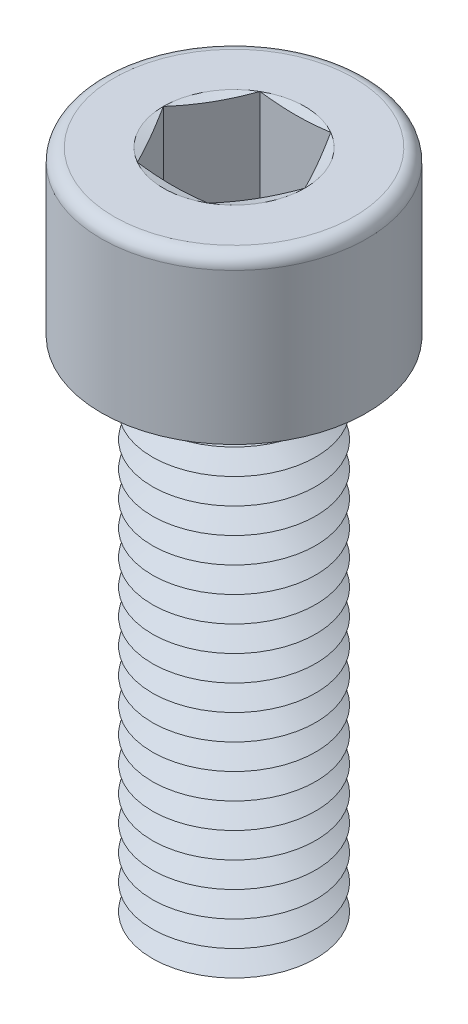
from build123d import *

# Parameters (mm, degrees)
SKETCH1_R       = 4
EXTRUDE1_DEPTH  = 25
SKETCH2_R       = 6.5
EXTRUDE2_DEPTH  = 8
EXTRUDE3_DEPTH  = 6
FILLET1_R       = 0.625
LPATTERN1_COUNT = 20
LPATTERN1_PITCH = 1.25


with BuildPart() as part:
    # Sketch1 → Extrude1 (new body)
    with BuildSketch(Plane(origin=(0, 0, 0), x_dir=(1, 0, 0), z_dir=(0, 1, 0))):
        with Locations(Location((0, 0, 0), (0, 0, 270))):
            Circle(SKETCH1_R)
    extrude(amount=EXTRUDE1_DEPTH)

    # Sketch2 → Extrude2 (add)
    with BuildSketch(Plane(origin=(0, 25, 0), x_dir=(1, 0, 0), z_dir=(0, 1, 0))):
        with Locations(Location((0, 0, 0), (0, 0, 270))):
            Circle(SKETCH2_R)
    extrude(amount=EXTRUDE2_DEPTH)

    # Sketch3 → Extrude3 (cut)
    with BuildSketch(Plane(origin=(0, 33, 0), x_dir=(1, 0, 0), z_dir=(0, 1, 0))):
        Polygon((1.732050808, 3), (-1.732050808, 3), (-3.464101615, 0), (-1.732050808, -3), (1.732050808, -3), (3.464101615, 0), align=None)
    extrude(amount=-EXTRUDE3_DEPTH, mode=Mode.SUBTRACT)

    # Fillet1
    fillet1_edges = [part.edges().sort_by_distance(p)[0] for p in [
        (0, 33, -6.5),
    ]]
    fillet(fillet1_edges, radius=FILLET1_R)

    # Sketch4 → Cut-Revolve1 (revolve, cut)
    with BuildSketch(Plane(origin=(0, 0, 0), x_dir=(0, 0, -1), z_dir=(1, 0, 0))):
        Polygon((-3, 27), (0, 27), (0, 25.267949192), align=None)
    revolve(axis=Axis((0, 27, 0), (0, -1, 0)), mode=Mode.SUBTRACT)

    # Sketch5 → Cut-Revolve2 (revolve, cut)
    with BuildSketch(Plane.XY, mode=Mode.PRIVATE) as cut_revolve2_sk:
        Polygon((-4, 0.625), (-4, -0.625), (-2.917468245, 0), align=None)
    cut_revolve2 = revolve(cut_revolve2_sk.sketch.rotate(Axis((0, 25, 0), (0, -1, 0)), 270), axis=Axis((0, 25, 0), (0, -1, 0)), mode=Mode.SUBTRACT)

    # LPattern1: Cut-Revolve2 ×20
    with Locations(*[(0, i * LPATTERN1_PITCH, 0) for i in range(1, LPATTERN1_COUNT)]):
        add(cut_revolve2, mode=Mode.SUBTRACT)

    # Extrude4 cone 1 section (on through the dimple's axis) → Extrude4 (revolve, cut)
    with BuildSketch(Plane(origin=(0, 33, 0), x_dir=(0, 0, 1), z_dir=(1, 0, 0))):
        Polygon((0, 0), (3.464101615, 0), (0, 0.92820323), align=None)
    revolve(axis=Axis((0, 33, 0), (0, -1, 0)), mode=Mode.SUBTRACT)


solid = part.part
